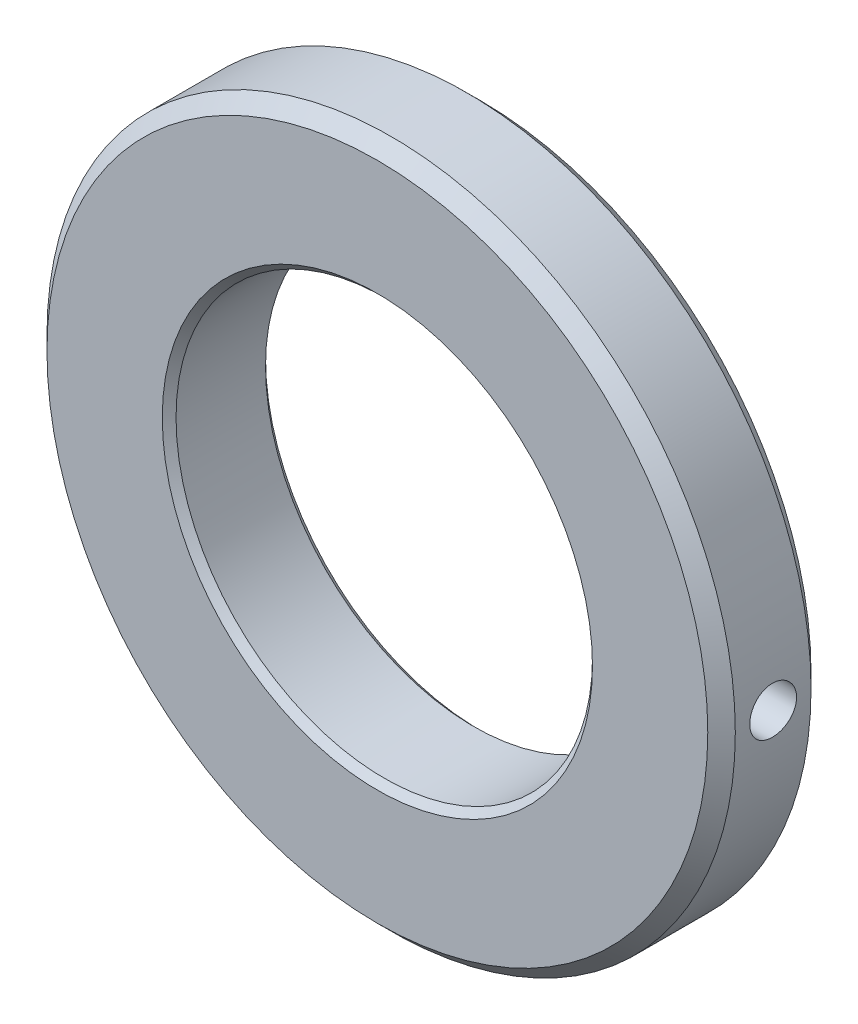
from build123d import *

# Parameters (mm, degrees)
ESQUISSE1_R                 = 50
ESQUISSE1_R_2               = 30.25
EXTRUSION1_DEPTH            = 7.5
CHANFREIN1_SIZE             = 1
CHANFREIN2_SIZE             = 2
TROU_TARAUD_M8X1_251_REACH  = 114.055
TROU_TARAUD_M8X1_251_BORE_R = 3.4


with BuildPart() as part:
    # Esquisse1 → Extrusion1 (new, symmetric)
    with BuildSketch(Plane.XY):
        Circle(ESQUISSE1_R)
        Circle(ESQUISSE1_R_2, mode=Mode.SUBTRACT)
    extrude(amount=EXTRUSION1_DEPTH, both=True)

    # Chanfrein1
    chanfrein1_edges = [part.edges().sort_by_distance(p)[0] for p in [
        (-30.25, 0, -7.5),
        (-30.25, 0, 7.5),
    ]]
    chamfer(chanfrein1_edges, length=CHANFREIN1_SIZE)

    # Chanfrein2
    chanfrein2_edges = [part.edges().sort_by_distance(p)[0] for p in [
        (-50, 0, -7.5),
        (-50, 0, 7.5),
    ]]
    chamfer(chanfrein2_edges, length=CHANFREIN2_SIZE)

    # Trou taraud_ M8x1.251 bore (on position points) → Trou taraud_ M8x1.251 (cut, up to next)
    with BuildSketch(Plane.YZ.offset(50), mode=Mode.PRIVATE) as trou_taraud_m8x1_251_sk1:
        Circle(TROU_TARAUD_M8X1_251_BORE_R)
    trou_taraud_m8x1_251_tool1 = extrude(trou_taraud_m8x1_251_sk1.sketch, amount=-TROU_TARAUD_M8X1_251_REACH, mode=Mode.PRIVATE) & part.part
    add(trou_taraud_m8x1_251_tool1.solids().sort_by_distance((50, 0, 0))[0], mode=Mode.SUBTRACT)


solid = part.part
